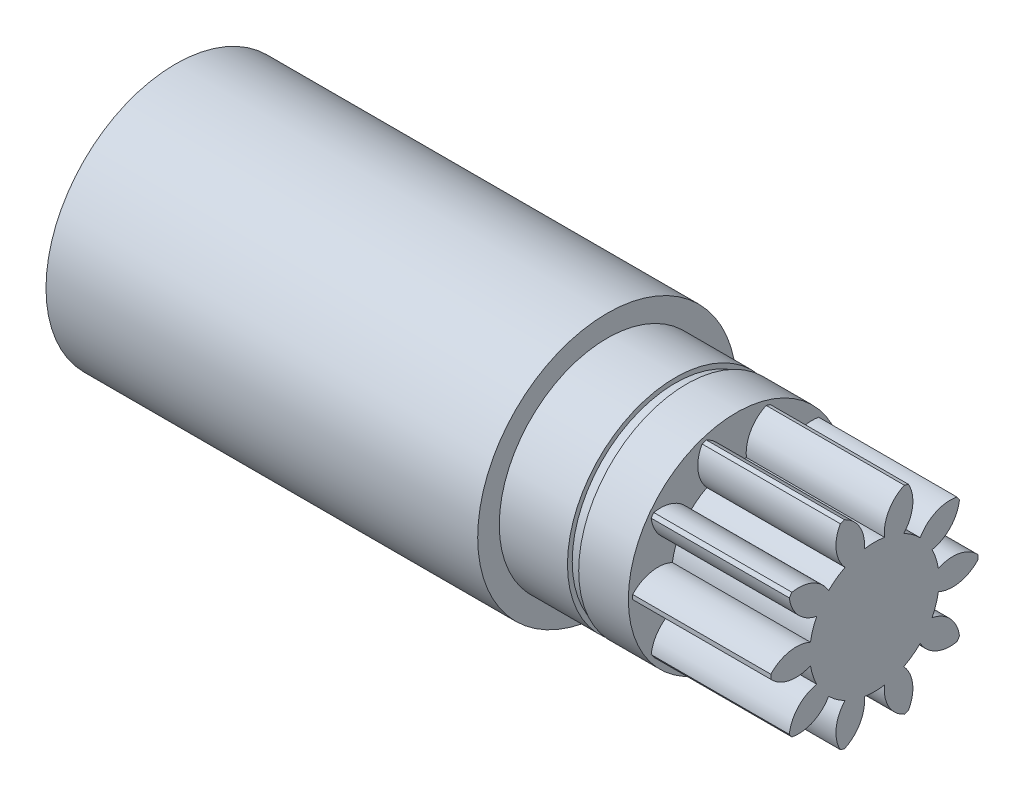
ISO-10303-21;
HEADER;
FILE_DESCRIPTION(('STEP AP214'),'2;1');
FILE_NAME('part.step','',(''),(''),'','','');
FILE_SCHEMA(('AUTOMOTIVE_DESIGN { 1 0 10303 214 1 1 1 1 }'));
ENDSEC;
DATA;
#1=APPLICATION_CONTEXT('core data for automotive mechanical design processes');
#2=APPLICATION_PROTOCOL_DEFINITION('international standard','automotive_design',2000,#1);
#3=PRODUCT_CONTEXT('',#1,'mechanical');
#4=PRODUCT('Part','Part','',(#3));
#5=PRODUCT_RELATED_PRODUCT_CATEGORY('part','',(#4));
#6=PRODUCT_DEFINITION_FORMATION('','',#4);
#7=PRODUCT_DEFINITION_CONTEXT('part definition',#1,'design');
#8=PRODUCT_DEFINITION('design','',#6,#7);
#9=PRODUCT_DEFINITION_SHAPE('','',#8);
#10=(LENGTH_UNIT() NAMED_UNIT(*) SI_UNIT(.MILLI.,.METRE.));
#11=(NAMED_UNIT(*) PLANE_ANGLE_UNIT() SI_UNIT($,.RADIAN.));
#12=(NAMED_UNIT(*) SI_UNIT($,.STERADIAN.) SOLID_ANGLE_UNIT());
#13=UNCERTAINTY_MEASURE_WITH_UNIT(LENGTH_MEASURE(1.E-05),#10,'distance_accuracy_value','');
#14=(GEOMETRIC_REPRESENTATION_CONTEXT(3) GLOBAL_UNCERTAINTY_ASSIGNED_CONTEXT((#13)) GLOBAL_UNIT_ASSIGNED_CONTEXT((#10,
#11,#12)) REPRESENTATION_CONTEXT('',''));
#15=CARTESIAN_POINT('',(0.,0.,0.));
#16=DIRECTION('',(0.,0.,1.));
#17=DIRECTION('',(1.,0.,0.));
#18=AXIS2_PLACEMENT_3D('',#15,#16,#17);
#19=CARTESIAN_POINT('',(-5.75,0.,0.));
#20=DIRECTION('',(-1.,0.,0.));
#21=DIRECTION('',(0.,0.,1.));
#22=AXIS2_PLACEMENT_3D('',#19,#20,#21);
#23=PLANE('',#22);
#24=CARTESIAN_POINT('',(-5.75,0.,0.));
#25=DIRECTION('',(-1.,0.,0.));
#26=DIRECTION('',(0.,0.,1.));
#27=AXIS2_PLACEMENT_3D('',#24,#25,#26);
#28=CIRCLE('',#27,12.5);
#29=CARTESIAN_POINT('',(-5.75,0.,12.5));
#30=VERTEX_POINT('',#29);
#31=EDGE_CURVE('E310',#30,#30,#28,.T.);
#32=ORIENTED_EDGE('',*,*,#31,.T.);
#33=EDGE_LOOP('',(#32));
#34=FACE_BOUND('',#33,.T.);
#35=CARTESIAN_POINT('',(-5.75,0.,0.));
#36=DIRECTION('',(-1.,0.,0.));
#37=DIRECTION('',(0.,0.,1.));
#38=AXIS2_PLACEMENT_3D('',#35,#36,#37);
#39=CIRCLE('',#38,11.95);
#40=CARTESIAN_POINT('',(-5.75,0.,11.95));
#41=VERTEX_POINT('',#40);
#42=EDGE_CURVE('E871',#41,#41,#39,.T.);
#43=ORIENTED_EDGE('',*,*,#42,.F.);
#44=EDGE_LOOP('',(#43));
#45=FACE_BOUND('',#44,.T.);
#46=ADVANCED_FACE('F31',(#34,#45),#23,.T.);
#47=CARTESIAN_POINT('',(16.,0.,0.));
#48=DIRECTION('',(-1.,0.,0.));
#49=DIRECTION('',(0.,0.,1.));
#50=AXIS2_PLACEMENT_3D('',#47,#48,#49);
#51=PLANE('',#50);
#52=CARTESIAN_POINT('',(16.,2.46642274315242,9.0674682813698));
#53=DIRECTION('',(-1.,0.,0.));
#54=DIRECTION('',(0.,0.951056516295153,0.309016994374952));
#55=AXIS2_PLACEMENT_3D('',#52,#53,#54);
#56=CIRCLE('',#55,4.);
#57=CARTESIAN_POINT('',(16.,-1.17254140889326,7.4067636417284));
#58=VERTEX_POINT('',#57);
#59=CARTESIAN_POINT('',(16.,-0.256880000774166,11.9972502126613));
#60=VERTEX_POINT('',#59);
#61=EDGE_CURVE('E437',#58,#60,#56,.T.);
#62=ORIENTED_EDGE('',*,*,#61,.F.);
#63=CARTESIAN_POINT('',(16.,0.,0.));
#64=DIRECTION('',(-1.,0.,0.));
#65=DIRECTION('',(0.,0.951056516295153,0.309016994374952));
#66=AXIS2_PLACEMENT_3D('',#63,#64,#65);
#67=CIRCLE('',#66,7.499);
#68=CARTESIAN_POINT('',(16.,-3.40498050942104,6.68140020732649));
#69=VERTEX_POINT('',#68);
#70=EDGE_CURVE('E441',#69,#58,#67,.T.);
#71=ORIENTED_EDGE('',*,*,#70,.F.);
#72=CARTESIAN_POINT('',(16.,-7.32510204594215,5.8860090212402));
#73=DIRECTION('',(-1.,0.,0.));
#74=DIRECTION('',(0.,0.951056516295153,0.309016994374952));
#75=AXIS2_PLACEMENT_3D('',#72,#73,#74);
#76=CIRCLE('',#75,4.);
#77=CARTESIAN_POINT('',(16.,-6.84398645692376,9.85696958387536));
#78=VERTEX_POINT('',#77);
#79=EDGE_CURVE('E439',#78,#69,#76,.T.);
#80=ORIENTED_EDGE('',*,*,#79,.F.);
#81=CARTESIAN_POINT('',(16.,0.,0.));
#82=DIRECTION('',(-1.,0.,0.));
#83=DIRECTION('',(0.,0.,1.));
#84=AXIS2_PLACEMENT_3D('',#81,#82,#83);
#85=CIRCLE('',#84,12.);
#86=CARTESIAN_POINT('',(16.,-7.25962702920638,9.55498903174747));
#87=VERTEX_POINT('',#86);
#88=EDGE_CURVE('E630',#87,#78,#85,.T.);
#89=ORIENTED_EDGE('',*,*,#88,.F.);
#90=CARTESIAN_POINT('',(16.,-3.33434621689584,8.78546284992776));
#91=DIRECTION('',(-1.,0.,0.));
#92=DIRECTION('',(0.,0.587785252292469,0.809016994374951));
#93=AXIS2_PLACEMENT_3D('',#90,#91,#92);
#94=CIRCLE('',#93,4.);
#95=CARTESIAN_POINT('',(16.,-5.30219236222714,5.30299511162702));
#96=VERTEX_POINT('',#95);
#97=EDGE_CURVE('E415',#96,#87,#94,.T.);
#98=ORIENTED_EDGE('',*,*,#97,.F.);
#99=CARTESIAN_POINT('',(16.,0.,0.));
#100=DIRECTION('',(-1.,0.,0.));
#101=DIRECTION('',(0.,0.587785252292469,0.809016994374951));
#102=AXIS2_PLACEMENT_3D('',#99,#100,#101);
#103=CIRCLE('',#102,7.499);
#104=CARTESIAN_POINT('',(16.,-6.68191560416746,3.40396898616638));
#105=VERTEX_POINT('',#104);
#106=EDGE_CURVE('E419',#105,#96,#103,.T.);
#107=ORIENTED_EDGE('',*,*,#106,.F.);
#108=CARTESIAN_POINT('',(16.,-9.38584133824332,0.456294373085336));
#109=DIRECTION('',(-1.,0.,0.));
#110=DIRECTION('',(0.,0.587785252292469,0.809016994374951));
#111=AXIS2_PLACEMENT_3D('',#108,#109,#110);
#112=CIRCLE('',#111,4.);
#113=CARTESIAN_POINT('',(16.,-11.3306827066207,3.95166160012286));
#114=VERTEX_POINT('',#113);
#115=EDGE_CURVE('E417',#114,#105,#112,.T.);
#116=ORIENTED_EDGE('',*,*,#115,.F.);
#117=CARTESIAN_POINT('',(16.,-11.4894432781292,3.46304680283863));
#118=VERTEX_POINT('',#117);
#119=EDGE_CURVE('E625',#118,#114,#85,.T.);
#120=ORIENTED_EDGE('',*,*,#119,.F.);
#121=CARTESIAN_POINT('',(16.,-7.86150825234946,5.14770921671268));
#122=DIRECTION('',(-1.,0.,0.));
#123=DIRECTION('',(0.,0.,1.));
#124=AXIS2_PLACEMENT_3D('',#121,#122,#123);
#125=CIRCLE('',#124,4.);
#126=CARTESIAN_POINT('',(16.,-7.40658604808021,1.17366269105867));
#127=VERTEX_POINT('',#126);
#128=EDGE_CURVE('E394',#127,#118,#125,.T.);
#129=ORIENTED_EDGE('',*,*,#128,.F.);
#130=CARTESIAN_POINT('',(16.,0.,0.));
#131=DIRECTION('',(-1.,0.,0.));
#132=DIRECTION('',(0.,0.,1.));
#133=AXIS2_PLACEMENT_3D('',#130,#131,#132);
#134=CIRCLE('',#133,7.499);
#135=CARTESIAN_POINT('',(16.,-7.40658604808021,-1.17366269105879));
#136=VERTEX_POINT('',#135);
#137=EDGE_CURVE('E398',#136,#127,#134,.T.);
#138=ORIENTED_EDGE('',*,*,#137,.F.);
#139=CARTESIAN_POINT('',(16.,-7.86150825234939,-5.14770921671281));
#140=DIRECTION('',(-1.,0.,0.));
#141=DIRECTION('',(0.,0.,1.));
#142=AXIS2_PLACEMENT_3D('',#139,#140,#141);
#143=CIRCLE('',#142,4.);
#144=CARTESIAN_POINT('',(16.,-11.4894432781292,-3.46304680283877));
#145=VERTEX_POINT('',#144);
#146=EDGE_CURVE('E396',#145,#136,#143,.T.);
#147=ORIENTED_EDGE('',*,*,#146,.F.);
#148=CARTESIAN_POINT('',(16.,-11.3306827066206,-3.95166160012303));
#149=VERTEX_POINT('',#148);
#150=EDGE_CURVE('E620',#149,#145,#85,.T.);
#151=ORIENTED_EDGE('',*,*,#150,.F.);
#152=CARTESIAN_POINT('',(16.,-9.3858413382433,-0.456294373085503));
#153=DIRECTION('',(-1.,0.,0.));
#154=DIRECTION('',(0.,-0.587785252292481,0.809016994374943));
#155=AXIS2_PLACEMENT_3D('',#152,#153,#154);
#156=CIRCLE('',#155,4.);
#157=CARTESIAN_POINT('',(16.,-6.68191560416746,-3.40396898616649));
#158=VERTEX_POINT('',#157);
#159=EDGE_CURVE('E372',#158,#149,#156,.T.);
#160=ORIENTED_EDGE('',*,*,#159,.F.);
#161=CARTESIAN_POINT('',(16.,0.,0.));
#162=DIRECTION('',(-1.,0.,0.));
#163=DIRECTION('',(0.,-0.587785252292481,0.809016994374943));
#164=AXIS2_PLACEMENT_3D('',#161,#162,#163);
#165=CIRCLE('',#164,7.499);
#166=CARTESIAN_POINT('',(16.,-5.30219236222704,-5.30299511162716));
#167=VERTEX_POINT('',#166);
#168=EDGE_CURVE('E376',#167,#158,#165,.T.);
#169=ORIENTED_EDGE('',*,*,#168,.F.);
#170=CARTESIAN_POINT('',(16.,-3.33434621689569,-8.78546284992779));
#171=DIRECTION('',(-1.,0.,0.));
#172=DIRECTION('',(0.,-0.587785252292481,0.809016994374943));
#173=AXIS2_PLACEMENT_3D('',#170,#171,#172);
#174=CIRCLE('',#173,4.);
#175=CARTESIAN_POINT('',(16.,-7.25962702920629,-9.55498903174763));
#176=VERTEX_POINT('',#175);
#177=EDGE_CURVE('E374',#176,#167,#174,.T.);
#178=ORIENTED_EDGE('',*,*,#177,.F.);
#179=CARTESIAN_POINT('',(16.,-6.84398645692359,-9.85696958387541));
#180=VERTEX_POINT('',#179);
#181=EDGE_CURVE('E615',#180,#176,#85,.T.);
#182=ORIENTED_EDGE('',*,*,#181,.F.);
#183=CARTESIAN_POINT('',(16.,-7.3251020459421,-5.88600902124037));
#184=DIRECTION('',(-1.,0.,0.));
#185=DIRECTION('',(0.,-0.951056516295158,0.309016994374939));
#186=AXIS2_PLACEMENT_3D('',#183,#184,#185);
#187=CIRCLE('',#186,4.);
#188=CARTESIAN_POINT('',(16.,-3.40498050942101,-6.68140020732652));
#189=VERTEX_POINT('',#188);
#190=EDGE_CURVE('E351',#189,#180,#187,.T.);
#191=ORIENTED_EDGE('',*,*,#190,.F.);
#192=CARTESIAN_POINT('',(16.,0.,0.));
#193=DIRECTION('',(-1.,0.,0.));
#194=DIRECTION('',(0.,-0.951056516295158,0.309016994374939));
#195=AXIS2_PLACEMENT_3D('',#192,#193,#194);
#196=CIRCLE('',#195,7.499);
#197=CARTESIAN_POINT('',(16.,-1.17254140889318,-7.40676364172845));
#198=VERTEX_POINT('',#197);
#199=EDGE_CURVE('E355',#198,#189,#196,.T.);
#200=ORIENTED_EDGE('',*,*,#199,.F.);
#201=CARTESIAN_POINT('',(16.,2.46642274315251,-9.06746828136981));
#202=DIRECTION('',(-1.,0.,0.));
#203=DIRECTION('',(0.,-0.951056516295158,0.309016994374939));
#204=AXIS2_PLACEMENT_3D('',#201,#202,#203);
#205=CIRCLE('',#204,4.);
#206=CARTESIAN_POINT('',(16.,-0.256880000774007,-11.9972502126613));
#207=VERTEX_POINT('',#206);
#208=EDGE_CURVE('E353',#207,#198,#205,.T.);
#209=ORIENTED_EDGE('',*,*,#208,.F.);
#210=CARTESIAN_POINT('',(16.,0.256880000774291,-11.9972502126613));
#211=VERTEX_POINT('',#210);
#212=EDGE_CURVE('E614',#211,#207,#85,.T.);
#213=ORIENTED_EDGE('',*,*,#212,.F.);
#214=CARTESIAN_POINT('',(16.,-2.46642274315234,-9.06746828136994));
#215=DIRECTION('',(-1.,0.,0.));
#216=DIRECTION('',(0.,-0.951056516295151,-0.309016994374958));
#217=AXIS2_PLACEMENT_3D('',#214,#215,#216);
#218=CIRCLE('',#217,4.);
#219=CARTESIAN_POINT('',(16.,1.17254140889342,-7.40676364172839));
#220=VERTEX_POINT('',#219);
#221=EDGE_CURVE('E332',#220,#211,#218,.T.);
#222=ORIENTED_EDGE('',*,*,#221,.F.);
#223=CARTESIAN_POINT('',(16.,0.,0.));
#224=DIRECTION('',(-1.,0.,0.));
#225=DIRECTION('',(0.,-0.951056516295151,-0.309016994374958));
#226=AXIS2_PLACEMENT_3D('',#223,#224,#225);
#227=CIRCLE('',#226,7.499);
#228=CARTESIAN_POINT('',(16.,3.40498050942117,-6.6814002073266));
#229=VERTEX_POINT('',#228);
#230=EDGE_CURVE('E336',#229,#220,#227,.T.);
#231=ORIENTED_EDGE('',*,*,#230,.F.);
#232=CARTESIAN_POINT('',(16.,7.32510204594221,-5.88600902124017));
#233=DIRECTION('',(-1.,0.,0.));
#234=DIRECTION('',(0.,-0.951056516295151,-0.309016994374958));
#235=AXIS2_PLACEMENT_3D('',#232,#233,#234);
#236=CIRCLE('',#235,4.);
#237=CARTESIAN_POINT('',(16.,6.84398645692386,-9.85696958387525));
#238=VERTEX_POINT('',#237);
#239=EDGE_CURVE('E334',#238,#229,#236,.T.);
#240=ORIENTED_EDGE('',*,*,#239,.F.);
#241=CARTESIAN_POINT('',(16.,7.2596270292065,-9.55498903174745));
#242=VERTEX_POINT('',#241);
#243=EDGE_CURVE('E528',#242,#238,#85,.T.);
#244=ORIENTED_EDGE('',*,*,#243,.F.);
#245=CARTESIAN_POINT('',(16.,3.33434621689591,-8.78546284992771));
#246=DIRECTION('',(-1.,0.,0.));
#247=DIRECTION('',(0.,-0.587785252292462,-0.809016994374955));
#248=AXIS2_PLACEMENT_3D('',#245,#246,#247);
#249=CIRCLE('',#248,4.);
#250=CARTESIAN_POINT('',(16.,5.30219236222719,-5.30299511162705));
#251=VERTEX_POINT('',#250);
#252=EDGE_CURVE('E316',#251,#242,#249,.T.);
#253=ORIENTED_EDGE('',*,*,#252,.F.);
#254=CARTESIAN_POINT('',(16.,0.,0.));
#255=DIRECTION('',(-1.,0.,0.));
#256=DIRECTION('',(0.,-0.587785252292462,-0.809016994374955));
#257=AXIS2_PLACEMENT_3D('',#254,#255,#256);
#258=CIRCLE('',#257,7.499);
#259=CARTESIAN_POINT('',(16.,6.68191560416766,-3.40396898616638));
#260=VERTEX_POINT('',#259);
#261=EDGE_CURVE('E297',#260,#251,#258,.T.);
#262=ORIENTED_EDGE('',*,*,#261,.F.);
#263=CARTESIAN_POINT('',(16.,9.38584133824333,-0.456294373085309));
#264=DIRECTION('',(-1.,0.,0.));
#265=DIRECTION('',(0.,-0.587785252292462,-0.809016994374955));
#266=AXIS2_PLACEMENT_3D('',#263,#264,#265);
#267=CIRCLE('',#266,4.);
#268=CARTESIAN_POINT('',(16.,11.3306827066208,-3.95166160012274));
#269=VERTEX_POINT('',#268);
#270=EDGE_CURVE('E318',#269,#260,#267,.T.);
#271=ORIENTED_EDGE('',*,*,#270,.F.);
#272=CARTESIAN_POINT('',(16.,11.4894432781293,-3.46304680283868));
#273=VERTEX_POINT('',#272);
#274=EDGE_CURVE('E524',#273,#269,#85,.T.);
#275=ORIENTED_EDGE('',*,*,#274,.F.);
#276=CARTESIAN_POINT('',(16.,7.86150825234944,-5.1477092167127));
#277=DIRECTION('',(-1.,0.,0.));
#278=DIRECTION('',(0.,0.,-1.));
#279=AXIS2_PLACEMENT_3D('',#276,#277,#278);
#280=CIRCLE('',#279,4.);
#281=CARTESIAN_POINT('',(16.,7.40658604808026,-1.17366269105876));
#282=VERTEX_POINT('',#281);
#283=EDGE_CURVE('E503',#282,#273,#280,.T.);
#284=ORIENTED_EDGE('',*,*,#283,.F.);
#285=CARTESIAN_POINT('',(16.,0.,0.));
#286=DIRECTION('',(-1.,0.,0.));
#287=DIRECTION('',(0.,0.,-1.));
#288=AXIS2_PLACEMENT_3D('',#285,#286,#287);
#289=CIRCLE('',#288,7.499);
#290=CARTESIAN_POINT('',(16.,7.40658604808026,1.1736626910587));
#291=VERTEX_POINT('',#290);
#292=EDGE_CURVE('E507',#291,#282,#289,.T.);
#293=ORIENTED_EDGE('',*,*,#292,.F.);
#294=CARTESIAN_POINT('',(16.,7.86150825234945,5.14770921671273));
#295=DIRECTION('',(-1.,0.,0.));
#296=DIRECTION('',(0.,0.,-1.));
#297=AXIS2_PLACEMENT_3D('',#294,#295,#296);
#298=CIRCLE('',#297,4.);
#299=CARTESIAN_POINT('',(16.,11.4894432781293,3.46304680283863));
#300=VERTEX_POINT('',#299);
#301=EDGE_CURVE('E505',#300,#291,#298,.T.);
#302=ORIENTED_EDGE('',*,*,#301,.F.);
#303=CARTESIAN_POINT('',(16.,11.3306827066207,3.95166160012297));
#304=VERTEX_POINT('',#303);
#305=EDGE_CURVE('E522',#304,#300,#85,.T.);
#306=ORIENTED_EDGE('',*,*,#305,.F.);
#307=CARTESIAN_POINT('',(16.,9.38584133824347,0.45629437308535));
#308=DIRECTION('',(-1.,0.,0.));
#309=DIRECTION('',(0.,0.587785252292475,-0.809016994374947));
#310=AXIS2_PLACEMENT_3D('',#307,#308,#309);
#311=CIRCLE('',#310,4.);
#312=CARTESIAN_POINT('',(16.,6.68191560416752,3.40396898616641));
#313=VERTEX_POINT('',#312);
#314=EDGE_CURVE('E481',#313,#304,#311,.T.);
#315=ORIENTED_EDGE('',*,*,#314,.F.);
#316=CARTESIAN_POINT('',(16.,0.,0.));
#317=DIRECTION('',(-1.,0.,0.));
#318=DIRECTION('',(0.,0.587785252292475,-0.809016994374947));
#319=AXIS2_PLACEMENT_3D('',#316,#317,#318);
#320=CIRCLE('',#319,7.499);
#321=CARTESIAN_POINT('',(16.,5.30219236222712,5.30299511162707));
#322=VERTEX_POINT('',#321);
#323=EDGE_CURVE('E485',#322,#313,#320,.T.);
#324=ORIENTED_EDGE('',*,*,#323,.F.);
#325=CARTESIAN_POINT('',(16.,3.33434621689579,8.78546284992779));
#326=DIRECTION('',(-1.,0.,0.));
#327=DIRECTION('',(0.,0.587785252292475,-0.809016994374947));
#328=AXIS2_PLACEMENT_3D('',#325,#326,#327);
#329=CIRCLE('',#328,4.);
#330=CARTESIAN_POINT('',(16.,7.25962702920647,9.55498903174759));
#331=VERTEX_POINT('',#330);
#332=EDGE_CURVE('E483',#331,#322,#329,.T.);
#333=ORIENTED_EDGE('',*,*,#332,.F.);
#334=CARTESIAN_POINT('',(16.,6.84398645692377,9.85696958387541));
#335=VERTEX_POINT('',#334);
#336=EDGE_CURVE('E640',#335,#331,#85,.T.);
#337=ORIENTED_EDGE('',*,*,#336,.F.);
#338=CARTESIAN_POINT('',(16.,7.32510204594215,5.88600902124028));
#339=DIRECTION('',(-1.,0.,0.));
#340=DIRECTION('',(0.,0.951056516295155,-0.309016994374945));
#341=AXIS2_PLACEMENT_3D('',#338,#339,#340);
#342=CIRCLE('',#341,4.);
#343=CARTESIAN_POINT('',(16.,3.40498050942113,6.68140020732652));
#344=VERTEX_POINT('',#343);
#345=EDGE_CURVE('E459',#344,#335,#342,.T.);
#346=ORIENTED_EDGE('',*,*,#345,.F.);
#347=CARTESIAN_POINT('',(16.,0.,0.));
#348=DIRECTION('',(-1.,0.,0.));
#349=DIRECTION('',(0.,0.951056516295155,-0.309016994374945));
#350=AXIS2_PLACEMENT_3D('',#347,#348,#349);
#351=CIRCLE('',#350,7.499);
#352=CARTESIAN_POINT('',(16.,1.17254140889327,7.40676364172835));
#353=VERTEX_POINT('',#352);
#354=EDGE_CURVE('E463',#353,#344,#351,.T.);
#355=ORIENTED_EDGE('',*,*,#354,.F.);
#356=CARTESIAN_POINT('',(16.,-2.46642274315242,9.06746828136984));
#357=DIRECTION('',(-1.,0.,0.));
#358=DIRECTION('',(0.,0.951056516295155,-0.309016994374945));
#359=AXIS2_PLACEMENT_3D('',#356,#357,#358);
#360=CIRCLE('',#359,4.);
#361=CARTESIAN_POINT('',(16.,0.256880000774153,11.9972502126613));
#362=VERTEX_POINT('',#361);
#363=EDGE_CURVE('E461',#362,#353,#360,.T.);
#364=ORIENTED_EDGE('',*,*,#363,.F.);
#365=EDGE_CURVE('E635',#60,#362,#85,.T.);
#366=ORIENTED_EDGE('',*,*,#365,.F.);
#367=EDGE_LOOP('',(#62,#71,#80,#89,#98,#107,#116,#120,#129,#138,#147,#151,#160,#169,#178,#182,
#191,#200,#209,#213,#222,#231,#240,#244,#253,#262,#271,#275,#284,#293,#302,#306,#315,#324,#333,
#337,#346,#355,#364,#366));
#368=FACE_BOUND('',#367,.T.);
#369=ADVANCED_FACE('F33',(#368),#51,.F.);
#370=CARTESIAN_POINT('',(-10.,0.,0.));
#371=DIRECTION('',(-1.,0.,0.));
#372=DIRECTION('',(0.,0.,1.));
#373=AXIS2_PLACEMENT_3D('',#370,#371,#372);
#374=CYLINDRICAL_SURFACE('',#373,12.);
#375=DIRECTION('',(-1.,0.,0.));
#376=VECTOR('',#375,1.);
#377=CARTESIAN_POINT('',(8.,7.2596270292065,-9.55498903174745));
#378=LINE('',#377,#376);
#379=CARTESIAN_POINT('',(0.,7.2596270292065,-9.55498903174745));
#380=VERTEX_POINT('',#379);
#381=EDGE_CURVE('E306',#242,#380,#378,.T.);
#382=ORIENTED_EDGE('',*,*,#381,.F.);
#383=ORIENTED_EDGE('',*,*,#243,.T.);
#384=DIRECTION('',(-1.,0.,0.));
#385=VECTOR('',#384,1.);
#386=CARTESIAN_POINT('',(8.,6.84398645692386,-9.85696958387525));
#387=LINE('',#386,#385);
#388=CARTESIAN_POINT('',(0.,6.84398645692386,-9.85696958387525));
#389=VERTEX_POINT('',#388);
#390=EDGE_CURVE('E342',#389,#238,#387,.F.);
#391=ORIENTED_EDGE('',*,*,#390,.F.);
#392=CARTESIAN_POINT('',(0.,0.,0.));
#393=DIRECTION('',(-1.,0.,0.));
#394=DIRECTION('',(0.,0.,1.));
#395=AXIS2_PLACEMENT_3D('',#392,#393,#394);
#396=CIRCLE('',#395,12.);
#397=EDGE_CURVE('E523',#380,#389,#396,.T.);
#398=ORIENTED_EDGE('',*,*,#397,.F.);
#399=EDGE_LOOP('',(#382,#383,#391,#398));
#400=FACE_BOUND('',#399,.T.);
#401=ADVANCED_FACE('F551',(#400),#374,.T.);
#402=DIRECTION('',(-1.,0.,0.));
#403=VECTOR('',#402,1.);
#404=CARTESIAN_POINT('',(8.,11.3306827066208,-3.95166160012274));
#405=LINE('',#404,#403);
#406=CARTESIAN_POINT('',(0.,11.3306827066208,-3.95166160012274));
#407=VERTEX_POINT('',#406);
#408=EDGE_CURVE('E325',#407,#269,#405,.F.);
#409=ORIENTED_EDGE('',*,*,#408,.F.);
#410=CARTESIAN_POINT('',(0.,11.4894432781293,-3.46304680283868));
#411=VERTEX_POINT('',#410);
#412=EDGE_CURVE('E520',#411,#407,#396,.T.);
#413=ORIENTED_EDGE('',*,*,#412,.F.);
#414=DIRECTION('',(-1.,0.,0.));
#415=VECTOR('',#414,1.);
#416=CARTESIAN_POINT('',(8.,11.4894432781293,-3.46304680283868));
#417=LINE('',#416,#415);
#418=EDGE_CURVE('E517',#273,#411,#417,.T.);
#419=ORIENTED_EDGE('',*,*,#418,.F.);
#420=ORIENTED_EDGE('',*,*,#274,.T.);
#421=EDGE_LOOP('',(#409,#413,#419,#420));
#422=FACE_BOUND('',#421,.T.);
#423=ADVANCED_FACE('F609',(#422),#374,.T.);
#424=DIRECTION('',(-1.,0.,0.));
#425=VECTOR('',#424,1.);
#426=CARTESIAN_POINT('',(8.,0.256880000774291,-11.9972502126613));
#427=LINE('',#426,#425);
#428=CARTESIAN_POINT('',(0.,0.256880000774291,-11.9972502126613));
#429=VERTEX_POINT('',#428);
#430=EDGE_CURVE('E345',#211,#429,#427,.T.);
#431=ORIENTED_EDGE('',*,*,#430,.F.);
#432=ORIENTED_EDGE('',*,*,#212,.T.);
#433=DIRECTION('',(-1.,0.,0.));
#434=VECTOR('',#433,1.);
#435=CARTESIAN_POINT('',(8.,-0.256880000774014,-11.9972502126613));
#436=LINE('',#435,#434);
#437=CARTESIAN_POINT('',(0.,-0.256880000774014,-11.9972502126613));
#438=VERTEX_POINT('',#437);
#439=EDGE_CURVE('E361',#438,#207,#436,.F.);
#440=ORIENTED_EDGE('',*,*,#439,.F.);
#441=EDGE_CURVE('E553',#429,#438,#396,.T.);
#442=ORIENTED_EDGE('',*,*,#441,.F.);
#443=EDGE_LOOP('',(#431,#432,#440,#442));
#444=FACE_BOUND('',#443,.T.);
#445=ADVANCED_FACE('F944',(#444),#374,.T.);
#446=DIRECTION('',(-1.,0.,0.));
#447=VECTOR('',#446,1.);
#448=CARTESIAN_POINT('',(8.,-6.84398645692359,-9.85696958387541));
#449=LINE('',#448,#447);
#450=CARTESIAN_POINT('',(0.,-6.84398645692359,-9.85696958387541));
#451=VERTEX_POINT('',#450);
#452=EDGE_CURVE('E364',#180,#451,#449,.T.);
#453=ORIENTED_EDGE('',*,*,#452,.F.);
#454=ORIENTED_EDGE('',*,*,#181,.T.);
#455=DIRECTION('',(-1.,0.,0.));
#456=VECTOR('',#455,1.);
#457=CARTESIAN_POINT('',(8.,-7.25962702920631,-9.55498903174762));
#458=LINE('',#457,#456);
#459=CARTESIAN_POINT('',(0.,-7.25962702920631,-9.55498903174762));
#460=VERTEX_POINT('',#459);
#461=EDGE_CURVE('E383',#460,#176,#458,.F.);
#462=ORIENTED_EDGE('',*,*,#461,.F.);
#463=EDGE_CURVE('E555',#451,#460,#396,.T.);
#464=ORIENTED_EDGE('',*,*,#463,.F.);
#465=EDGE_LOOP('',(#453,#454,#462,#464));
#466=FACE_BOUND('',#465,.T.);
#467=ADVANCED_FACE('F938',(#466),#374,.T.);
#468=DIRECTION('',(-1.,0.,0.));
#469=VECTOR('',#468,1.);
#470=CARTESIAN_POINT('',(8.,-11.3306827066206,-3.95166160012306));
#471=LINE('',#470,#469);
#472=CARTESIAN_POINT('',(0.,-11.3306827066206,-3.95166160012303));
#473=VERTEX_POINT('',#472);
#474=EDGE_CURVE('E386',#149,#473,#471,.T.);
#475=ORIENTED_EDGE('',*,*,#474,.F.);
#476=ORIENTED_EDGE('',*,*,#150,.T.);
#477=DIRECTION('',(-1.,0.,0.));
#478=VECTOR('',#477,1.);
#479=CARTESIAN_POINT('',(8.,-11.4894432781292,-3.46304680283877));
#480=LINE('',#479,#478);
#481=CARTESIAN_POINT('',(0.,-11.4894432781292,-3.46304680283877));
#482=VERTEX_POINT('',#481);
#483=EDGE_CURVE('E405',#482,#145,#480,.F.);
#484=ORIENTED_EDGE('',*,*,#483,.F.);
#485=EDGE_CURVE('E559',#473,#482,#396,.T.);
#486=ORIENTED_EDGE('',*,*,#485,.F.);
#487=EDGE_LOOP('',(#475,#476,#484,#486));
#488=FACE_BOUND('',#487,.T.);
#489=ADVANCED_FACE('F931',(#488),#374,.T.);
#490=DIRECTION('',(-1.,0.,0.));
#491=VECTOR('',#490,1.);
#492=CARTESIAN_POINT('',(8.,-11.4894432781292,3.46304680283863));
#493=LINE('',#492,#491);
#494=CARTESIAN_POINT('',(0.,-11.4894432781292,3.46304680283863));
#495=VERTEX_POINT('',#494);
#496=EDGE_CURVE('E408',#118,#495,#493,.T.);
#497=ORIENTED_EDGE('',*,*,#496,.F.);
#498=ORIENTED_EDGE('',*,*,#119,.T.);
#499=DIRECTION('',(-1.,0.,0.));
#500=VECTOR('',#499,1.);
#501=CARTESIAN_POINT('',(8.,-11.3306827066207,3.95166160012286));
#502=LINE('',#501,#500);
#503=CARTESIAN_POINT('',(0.,-11.3306827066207,3.95166160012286));
#504=VERTEX_POINT('',#503);
#505=EDGE_CURVE('E426',#504,#114,#502,.F.);
#506=ORIENTED_EDGE('',*,*,#505,.F.);
#507=EDGE_CURVE('E563',#495,#504,#396,.T.);
#508=ORIENTED_EDGE('',*,*,#507,.F.);
#509=EDGE_LOOP('',(#497,#498,#506,#508));
#510=FACE_BOUND('',#509,.T.);
#511=ADVANCED_FACE('F924',(#510),#374,.T.);
#512=DIRECTION('',(-1.,0.,0.));
#513=VECTOR('',#512,1.);
#514=CARTESIAN_POINT('',(8.,-7.25962702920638,9.55498903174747));
#515=LINE('',#514,#513);
#516=CARTESIAN_POINT('',(0.,-7.25962702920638,9.55498903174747));
#517=VERTEX_POINT('',#516);
#518=EDGE_CURVE('E429',#87,#517,#515,.T.);
#519=ORIENTED_EDGE('',*,*,#518,.F.);
#520=ORIENTED_EDGE('',*,*,#88,.T.);
#521=DIRECTION('',(-1.,0.,0.));
#522=VECTOR('',#521,1.);
#523=CARTESIAN_POINT('',(8.,-6.84398645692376,9.85696958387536));
#524=LINE('',#523,#522);
#525=CARTESIAN_POINT('',(0.,-6.84398645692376,9.85696958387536));
#526=VERTEX_POINT('',#525);
#527=EDGE_CURVE('E448',#526,#78,#524,.F.);
#528=ORIENTED_EDGE('',*,*,#527,.F.);
#529=EDGE_CURVE('E567',#517,#526,#396,.T.);
#530=ORIENTED_EDGE('',*,*,#529,.F.);
#531=EDGE_LOOP('',(#519,#520,#528,#530));
#532=FACE_BOUND('',#531,.T.);
#533=ADVANCED_FACE('F917',(#532),#374,.T.);
#534=DIRECTION('',(-1.,0.,0.));
#535=VECTOR('',#534,1.);
#536=CARTESIAN_POINT('',(8.,-0.256880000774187,11.9972502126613));
#537=LINE('',#536,#535);
#538=CARTESIAN_POINT('',(0.,-0.256880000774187,11.9972502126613));
#539=VERTEX_POINT('',#538);
#540=EDGE_CURVE('E451',#60,#539,#537,.T.);
#541=ORIENTED_EDGE('',*,*,#540,.F.);
#542=ORIENTED_EDGE('',*,*,#365,.T.);
#543=DIRECTION('',(-1.,0.,0.));
#544=VECTOR('',#543,1.);
#545=CARTESIAN_POINT('',(8.,0.256880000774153,11.9972502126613));
#546=LINE('',#545,#544);
#547=CARTESIAN_POINT('',(0.,0.256880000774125,11.9972502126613));
#548=VERTEX_POINT('',#547);
#549=EDGE_CURVE('E470',#548,#362,#546,.F.);
#550=ORIENTED_EDGE('',*,*,#549,.F.);
#551=EDGE_CURVE('E571',#539,#548,#396,.T.);
#552=ORIENTED_EDGE('',*,*,#551,.F.);
#553=EDGE_LOOP('',(#541,#542,#550,#552));
#554=FACE_BOUND('',#553,.T.);
#555=ADVANCED_FACE('F910',(#554),#374,.T.);
#556=DIRECTION('',(-1.,0.,0.));
#557=VECTOR('',#556,1.);
#558=CARTESIAN_POINT('',(8.,6.84398645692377,9.85696958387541));
#559=LINE('',#558,#557);
#560=CARTESIAN_POINT('',(0.,6.84398645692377,9.85696958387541));
#561=VERTEX_POINT('',#560);
#562=EDGE_CURVE('E473',#335,#561,#559,.T.);
#563=ORIENTED_EDGE('',*,*,#562,.F.);
#564=ORIENTED_EDGE('',*,*,#336,.T.);
#565=DIRECTION('',(-1.,0.,0.));
#566=VECTOR('',#565,1.);
#567=CARTESIAN_POINT('',(8.,7.25962702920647,9.55498903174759));
#568=LINE('',#567,#566);
#569=CARTESIAN_POINT('',(0.,7.25962702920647,9.55498903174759));
#570=VERTEX_POINT('',#569);
#571=EDGE_CURVE('E492',#570,#331,#568,.F.);
#572=ORIENTED_EDGE('',*,*,#571,.F.);
#573=EDGE_CURVE('E575',#561,#570,#396,.T.);
#574=ORIENTED_EDGE('',*,*,#573,.F.);
#575=EDGE_LOOP('',(#563,#564,#572,#574));
#576=FACE_BOUND('',#575,.T.);
#577=ADVANCED_FACE('F649',(#576),#374,.T.);
#578=DIRECTION('',(-1.,0.,0.));
#579=VECTOR('',#578,1.);
#580=CARTESIAN_POINT('',(8.,11.3306827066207,3.95166160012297));
#581=LINE('',#580,#579);
#582=CARTESIAN_POINT('',(0.,11.3306827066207,3.95166160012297));
#583=VERTEX_POINT('',#582);
#584=EDGE_CURVE('E495',#304,#583,#581,.T.);
#585=ORIENTED_EDGE('',*,*,#584,.F.);
#586=ORIENTED_EDGE('',*,*,#305,.T.);
#587=DIRECTION('',(-1.,0.,0.));
#588=VECTOR('',#587,1.);
#589=CARTESIAN_POINT('',(8.,11.4894432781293,3.46304680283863));
#590=LINE('',#589,#588);
#591=CARTESIAN_POINT('',(0.,11.4894432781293,3.46304680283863));
#592=VERTEX_POINT('',#591);
#593=EDGE_CURVE('E514',#592,#300,#590,.F.);
#594=ORIENTED_EDGE('',*,*,#593,.F.);
#595=EDGE_CURVE('E519',#583,#592,#396,.T.);
#596=ORIENTED_EDGE('',*,*,#595,.F.);
#597=EDGE_LOOP('',(#585,#586,#594,#596));
#598=FACE_BOUND('',#597,.T.);
#599=ADVANCED_FACE('F587',(#598),#374,.T.);
#600=CARTESIAN_POINT('',(16.,7.86150825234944,-5.1477092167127));
#601=DIRECTION('',(-1.,0.,0.));
#602=DIRECTION('',(0.,0.,1.));
#603=AXIS2_PLACEMENT_3D('',#600,#601,#602);
#604=CYLINDRICAL_SURFACE('',#603,4.);
#605=ORIENTED_EDGE('',*,*,#418,.T.);
#606=CARTESIAN_POINT('',(0.,7.86150825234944,-5.1477092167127));
#607=DIRECTION('',(-1.,0.,0.));
#608=DIRECTION('',(0.,0.,-1.));
#609=AXIS2_PLACEMENT_3D('',#606,#607,#608);
#610=CIRCLE('',#609,4.);
#611=CARTESIAN_POINT('',(0.,7.40658604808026,-1.17366269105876));
#612=VERTEX_POINT('',#611);
#613=EDGE_CURVE('E497',#612,#411,#610,.T.);
#614=ORIENTED_EDGE('',*,*,#613,.F.);
#615=DIRECTION('',(-1.,0.,0.));
#616=VECTOR('',#615,1.);
#617=CARTESIAN_POINT('',(16.,7.40658604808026,-1.17366269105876));
#618=LINE('',#617,#616);
#619=EDGE_CURVE('E509',#282,#612,#618,.T.);
#620=ORIENTED_EDGE('',*,*,#619,.F.);
#621=ORIENTED_EDGE('',*,*,#283,.T.);
#622=EDGE_LOOP('',(#605,#614,#620,#621));
#623=FACE_BOUND('',#622,.T.);
#624=ADVANCED_FACE('F604',(#623),#604,.T.);
#625=CARTESIAN_POINT('',(16.,7.86150825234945,5.14770921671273));
#626=DIRECTION('',(-1.,0.,0.));
#627=DIRECTION('',(0.,0.,1.));
#628=AXIS2_PLACEMENT_3D('',#625,#626,#627);
#629=CYLINDRICAL_SURFACE('',#628,4.);
#630=ORIENTED_EDGE('',*,*,#593,.T.);
#631=ORIENTED_EDGE('',*,*,#301,.T.);
#632=DIRECTION('',(-1.,0.,0.));
#633=VECTOR('',#632,1.);
#634=CARTESIAN_POINT('',(16.,7.40658604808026,1.1736626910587));
#635=LINE('',#634,#633);
#636=CARTESIAN_POINT('',(0.,7.40658604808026,1.1736626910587));
#637=VERTEX_POINT('',#636);
#638=EDGE_CURVE('E512',#291,#637,#635,.T.);
#639=ORIENTED_EDGE('',*,*,#638,.T.);
#640=CARTESIAN_POINT('',(0.,7.86150825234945,5.14770921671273));
#641=DIRECTION('',(1.,0.,0.));
#642=DIRECTION('',(0.,0.,-1.));
#643=AXIS2_PLACEMENT_3D('',#640,#641,#642);
#644=CIRCLE('',#643,4.);
#645=EDGE_CURVE('E527',#637,#592,#644,.T.);
#646=ORIENTED_EDGE('',*,*,#645,.T.);
#647=EDGE_LOOP('',(#630,#631,#639,#646));
#648=FACE_BOUND('',#647,.T.);
#649=ADVANCED_FACE('F591',(#648),#629,.T.);
#650=CARTESIAN_POINT('',(16.,0.,0.));
#651=DIRECTION('',(-1.,0.,0.));
#652=DIRECTION('',(0.,0.,1.));
#653=AXIS2_PLACEMENT_3D('',#650,#651,#652);
#654=CYLINDRICAL_SURFACE('',#653,7.499);
#655=CARTESIAN_POINT('',(0.,0.,0.));
#656=DIRECTION('',(-1.,0.,0.));
#657=DIRECTION('',(0.,0.,-1.));
#658=AXIS2_PLACEMENT_3D('',#655,#656,#657);
#659=CIRCLE('',#658,7.499);
#660=EDGE_CURVE('E500',#637,#612,#659,.T.);
#661=ORIENTED_EDGE('',*,*,#660,.F.);
#662=ORIENTED_EDGE('',*,*,#638,.F.);
#663=ORIENTED_EDGE('',*,*,#292,.T.);
#664=ORIENTED_EDGE('',*,*,#619,.T.);
#665=EDGE_LOOP('',(#661,#662,#663,#664));
#666=FACE_BOUND('',#665,.T.);
#667=ADVANCED_FACE('F602',(#666),#654,.T.);
#668=CARTESIAN_POINT('',(16.,9.38584133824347,0.45629437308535));
#669=DIRECTION('',(-1.,0.,0.));
#670=DIRECTION('',(0.,0.,1.));
#671=AXIS2_PLACEMENT_3D('',#668,#669,#670);
#672=CYLINDRICAL_SURFACE('',#671,4.);
#673=ORIENTED_EDGE('',*,*,#584,.T.);
#674=CARTESIAN_POINT('',(0.,9.38584133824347,0.45629437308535));
#675=DIRECTION('',(-1.,0.,0.));
#676=DIRECTION('',(0.,0.587785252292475,-0.809016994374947));
#677=AXIS2_PLACEMENT_3D('',#674,#675,#676);
#678=CIRCLE('',#677,4.);
#679=CARTESIAN_POINT('',(0.,6.68191560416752,3.40396898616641));
#680=VERTEX_POINT('',#679);
#681=EDGE_CURVE('E475',#680,#583,#678,.T.);
#682=ORIENTED_EDGE('',*,*,#681,.F.);
#683=DIRECTION('',(-1.,0.,0.));
#684=VECTOR('',#683,1.);
#685=CARTESIAN_POINT('',(16.,6.68191560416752,3.40396898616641));
#686=LINE('',#685,#684);
#687=EDGE_CURVE('E487',#313,#680,#686,.T.);
#688=ORIENTED_EDGE('',*,*,#687,.F.);
#689=ORIENTED_EDGE('',*,*,#314,.T.);
#690=EDGE_LOOP('',(#673,#682,#688,#689));
#691=FACE_BOUND('',#690,.T.);
#692=ADVANCED_FACE('F661',(#691),#672,.T.);
#693=CARTESIAN_POINT('',(16.,3.33434621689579,8.78546284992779));
#694=DIRECTION('',(-1.,0.,0.));
#695=DIRECTION('',(0.,0.,1.));
#696=AXIS2_PLACEMENT_3D('',#693,#694,#695);
#697=CYLINDRICAL_SURFACE('',#696,4.);
#698=ORIENTED_EDGE('',*,*,#571,.T.);
#699=ORIENTED_EDGE('',*,*,#332,.T.);
#700=DIRECTION('',(-1.,0.,0.));
#701=VECTOR('',#700,1.);
#702=CARTESIAN_POINT('',(16.,5.30219236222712,5.30299511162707));
#703=LINE('',#702,#701);
#704=CARTESIAN_POINT('',(0.,5.30219236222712,5.30299511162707));
#705=VERTEX_POINT('',#704);
#706=EDGE_CURVE('E490',#322,#705,#703,.T.);
#707=ORIENTED_EDGE('',*,*,#706,.T.);
#708=CARTESIAN_POINT('',(0.,3.33434621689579,8.78546284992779));
#709=DIRECTION('',(1.,0.,0.));
#710=DIRECTION('',(0.,0.,-1.));
#711=AXIS2_PLACEMENT_3D('',#708,#709,#710);
#712=CIRCLE('',#711,4.);
#713=EDGE_CURVE('E530',#705,#570,#712,.T.);
#714=ORIENTED_EDGE('',*,*,#713,.T.);
#715=EDGE_LOOP('',(#698,#699,#707,#714));
#716=FACE_BOUND('',#715,.T.);
#717=ADVANCED_FACE('F653',(#716),#697,.T.);
#718=CARTESIAN_POINT('',(16.,0.,0.));
#719=DIRECTION('',(-1.,0.,0.));
#720=DIRECTION('',(0.,0.,1.));
#721=AXIS2_PLACEMENT_3D('',#718,#719,#720);
#722=CYLINDRICAL_SURFACE('',#721,7.499);
#723=CARTESIAN_POINT('',(0.,0.,0.));
#724=DIRECTION('',(-1.,0.,0.));
#725=DIRECTION('',(0.,0.587785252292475,-0.809016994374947));
#726=AXIS2_PLACEMENT_3D('',#723,#724,#725);
#727=CIRCLE('',#726,7.499);
#728=EDGE_CURVE('E478',#705,#680,#727,.T.);
#729=ORIENTED_EDGE('',*,*,#728,.F.);
#730=ORIENTED_EDGE('',*,*,#706,.F.);
#731=ORIENTED_EDGE('',*,*,#323,.T.);
#732=ORIENTED_EDGE('',*,*,#687,.T.);
#733=EDGE_LOOP('',(#729,#730,#731,#732));
#734=FACE_BOUND('',#733,.T.);
#735=ADVANCED_FACE('F659',(#734),#722,.T.);
#736=CARTESIAN_POINT('',(16.,7.32510204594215,5.88600902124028));
#737=DIRECTION('',(-1.,0.,0.));
#738=DIRECTION('',(0.,0.,1.));
#739=AXIS2_PLACEMENT_3D('',#736,#737,#738);
#740=CYLINDRICAL_SURFACE('',#739,4.);
#741=ORIENTED_EDGE('',*,*,#562,.T.);
#742=CARTESIAN_POINT('',(0.,7.32510204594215,5.88600902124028));
#743=DIRECTION('',(-1.,0.,0.));
#744=DIRECTION('',(0.,0.951056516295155,-0.309016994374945));
#745=AXIS2_PLACEMENT_3D('',#742,#743,#744);
#746=CIRCLE('',#745,4.);
#747=CARTESIAN_POINT('',(0.,3.40498050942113,6.68140020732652));
#748=VERTEX_POINT('',#747);
#749=EDGE_CURVE('E453',#748,#561,#746,.T.);
#750=ORIENTED_EDGE('',*,*,#749,.F.);
#751=DIRECTION('',(-1.,0.,0.));
#752=VECTOR('',#751,1.);
#753=CARTESIAN_POINT('',(16.,3.40498050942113,6.68140020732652));
#754=LINE('',#753,#752);
#755=EDGE_CURVE('E465',#344,#748,#754,.T.);
#756=ORIENTED_EDGE('',*,*,#755,.F.);
#757=ORIENTED_EDGE('',*,*,#345,.T.);
#758=EDGE_LOOP('',(#741,#750,#756,#757));
#759=FACE_BOUND('',#758,.T.);
#760=ADVANCED_FACE('F769',(#759),#740,.T.);
#761=CARTESIAN_POINT('',(16.,-2.46642274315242,9.06746828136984));
#762=DIRECTION('',(-1.,0.,0.));
#763=DIRECTION('',(0.,0.,1.));
#764=AXIS2_PLACEMENT_3D('',#761,#762,#763);
#765=CYLINDRICAL_SURFACE('',#764,4.);
#766=ORIENTED_EDGE('',*,*,#549,.T.);
#767=ORIENTED_EDGE('',*,*,#363,.T.);
#768=DIRECTION('',(-1.,0.,0.));
#769=VECTOR('',#768,1.);
#770=CARTESIAN_POINT('',(16.,1.17254140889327,7.40676364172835));
#771=LINE('',#770,#769);
#772=CARTESIAN_POINT('',(0.,1.17254140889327,7.40676364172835));
#773=VERTEX_POINT('',#772);
#774=EDGE_CURVE('E468',#353,#773,#771,.T.);
#775=ORIENTED_EDGE('',*,*,#774,.T.);
#776=CARTESIAN_POINT('',(0.,-2.46642274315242,9.06746828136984));
#777=DIRECTION('',(1.,0.,0.));
#778=DIRECTION('',(0.,0.,-1.));
#779=AXIS2_PLACEMENT_3D('',#776,#777,#778);
#780=CIRCLE('',#779,4.);
#781=EDGE_CURVE('E532',#773,#548,#780,.T.);
#782=ORIENTED_EDGE('',*,*,#781,.T.);
#783=EDGE_LOOP('',(#766,#767,#775,#782));
#784=FACE_BOUND('',#783,.T.);
#785=ADVANCED_FACE('F765',(#784),#765,.T.);
#786=CARTESIAN_POINT('',(16.,0.,0.));
#787=DIRECTION('',(-1.,0.,0.));
#788=DIRECTION('',(0.,0.,1.));
#789=AXIS2_PLACEMENT_3D('',#786,#787,#788);
#790=CYLINDRICAL_SURFACE('',#789,7.499);
#791=CARTESIAN_POINT('',(0.,0.,0.));
#792=DIRECTION('',(-1.,0.,0.));
#793=DIRECTION('',(0.,0.951056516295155,-0.309016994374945));
#794=AXIS2_PLACEMENT_3D('',#791,#792,#793);
#795=CIRCLE('',#794,7.499);
#796=EDGE_CURVE('E456',#773,#748,#795,.T.);
#797=ORIENTED_EDGE('',*,*,#796,.F.);
#798=ORIENTED_EDGE('',*,*,#774,.F.);
#799=ORIENTED_EDGE('',*,*,#354,.T.);
#800=ORIENTED_EDGE('',*,*,#755,.T.);
#801=EDGE_LOOP('',(#797,#798,#799,#800));
#802=FACE_BOUND('',#801,.T.);
#803=ADVANCED_FACE('F761',(#802),#790,.T.);
#804=CARTESIAN_POINT('',(16.,2.46642274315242,9.0674682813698));
#805=DIRECTION('',(-1.,0.,0.));
#806=DIRECTION('',(0.,0.,1.));
#807=AXIS2_PLACEMENT_3D('',#804,#805,#806);
#808=CYLINDRICAL_SURFACE('',#807,4.);
#809=ORIENTED_EDGE('',*,*,#540,.T.);
#810=CARTESIAN_POINT('',(0.,2.46642274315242,9.0674682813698));
#811=DIRECTION('',(-1.,0.,0.));
#812=DIRECTION('',(0.,0.951056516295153,0.309016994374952));
#813=AXIS2_PLACEMENT_3D('',#810,#811,#812);
#814=CIRCLE('',#813,4.);
#815=CARTESIAN_POINT('',(0.,-1.17254140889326,7.4067636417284));
#816=VERTEX_POINT('',#815);
#817=EDGE_CURVE('E431',#816,#539,#814,.T.);
#818=ORIENTED_EDGE('',*,*,#817,.F.);
#819=DIRECTION('',(-1.,0.,0.));
#820=VECTOR('',#819,1.);
#821=CARTESIAN_POINT('',(16.,-1.17254140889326,7.4067636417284));
#822=LINE('',#821,#820);
#823=EDGE_CURVE('E443',#58,#816,#822,.T.);
#824=ORIENTED_EDGE('',*,*,#823,.F.);
#825=ORIENTED_EDGE('',*,*,#61,.T.);
#826=EDGE_LOOP('',(#809,#818,#824,#825));
#827=FACE_BOUND('',#826,.T.);
#828=ADVANCED_FACE('F757',(#827),#808,.T.);
#829=CARTESIAN_POINT('',(16.,-7.32510204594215,5.8860090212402));
#830=DIRECTION('',(-1.,0.,0.));
#831=DIRECTION('',(0.,0.,1.));
#832=AXIS2_PLACEMENT_3D('',#829,#830,#831);
#833=CYLINDRICAL_SURFACE('',#832,4.);
#834=ORIENTED_EDGE('',*,*,#527,.T.);
#835=ORIENTED_EDGE('',*,*,#79,.T.);
#836=DIRECTION('',(-1.,0.,0.));
#837=VECTOR('',#836,1.);
#838=CARTESIAN_POINT('',(16.,-3.40498050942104,6.68140020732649));
#839=LINE('',#838,#837);
#840=CARTESIAN_POINT('',(0.,-3.40498050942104,6.68140020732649));
#841=VERTEX_POINT('',#840);
#842=EDGE_CURVE('E446',#69,#841,#839,.T.);
#843=ORIENTED_EDGE('',*,*,#842,.T.);
#844=CARTESIAN_POINT('',(0.,-7.32510204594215,5.8860090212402));
#845=DIRECTION('',(1.,0.,0.));
#846=DIRECTION('',(0.,0.,-1.));
#847=AXIS2_PLACEMENT_3D('',#844,#845,#846);
#848=CIRCLE('',#847,4.);
#849=EDGE_CURVE('E534',#841,#526,#848,.T.);
#850=ORIENTED_EDGE('',*,*,#849,.T.);
#851=EDGE_LOOP('',(#834,#835,#843,#850));
#852=FACE_BOUND('',#851,.T.);
#853=ADVANCED_FACE('F753',(#852),#833,.T.);
#854=CARTESIAN_POINT('',(16.,0.,0.));
#855=DIRECTION('',(-1.,0.,0.));
#856=DIRECTION('',(0.,0.,1.));
#857=AXIS2_PLACEMENT_3D('',#854,#855,#856);
#858=CYLINDRICAL_SURFACE('',#857,7.499);
#859=CARTESIAN_POINT('',(0.,0.,0.));
#860=DIRECTION('',(-1.,0.,0.));
#861=DIRECTION('',(0.,0.951056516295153,0.309016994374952));
#862=AXIS2_PLACEMENT_3D('',#859,#860,#861);
#863=CIRCLE('',#862,7.499);
#864=EDGE_CURVE('E434',#841,#816,#863,.T.);
#865=ORIENTED_EDGE('',*,*,#864,.F.);
#866=ORIENTED_EDGE('',*,*,#842,.F.);
#867=ORIENTED_EDGE('',*,*,#70,.T.);
#868=ORIENTED_EDGE('',*,*,#823,.T.);
#869=EDGE_LOOP('',(#865,#866,#867,#868));
#870=FACE_BOUND('',#869,.T.);
#871=ADVANCED_FACE('F749',(#870),#858,.T.);
#872=CARTESIAN_POINT('',(16.,-3.33434621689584,8.78546284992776));
#873=DIRECTION('',(-1.,0.,0.));
#874=DIRECTION('',(0.,0.,1.));
#875=AXIS2_PLACEMENT_3D('',#872,#873,#874);
#876=CYLINDRICAL_SURFACE('',#875,4.);
#877=ORIENTED_EDGE('',*,*,#518,.T.);
#878=CARTESIAN_POINT('',(0.,-3.33434621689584,8.78546284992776));
#879=DIRECTION('',(-1.,0.,0.));
#880=DIRECTION('',(0.,0.587785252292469,0.809016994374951));
#881=AXIS2_PLACEMENT_3D('',#878,#879,#880);
#882=CIRCLE('',#881,4.);
#883=CARTESIAN_POINT('',(0.,-5.30219236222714,5.30299511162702));
#884=VERTEX_POINT('',#883);
#885=EDGE_CURVE('E410',#884,#517,#882,.T.);
#886=ORIENTED_EDGE('',*,*,#885,.F.);
#887=DIRECTION('',(-1.,0.,0.));
#888=VECTOR('',#887,1.);
#889=CARTESIAN_POINT('',(16.,-5.30219236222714,5.30299511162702));
#890=LINE('',#889,#888);
#891=EDGE_CURVE('E421',#96,#884,#890,.T.);
#892=ORIENTED_EDGE('',*,*,#891,.F.);
#893=ORIENTED_EDGE('',*,*,#97,.T.);
#894=EDGE_LOOP('',(#877,#886,#892,#893));
#895=FACE_BOUND('',#894,.T.);
#896=ADVANCED_FACE('F745',(#895),#876,.T.);
#897=CARTESIAN_POINT('',(16.,-9.38584133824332,0.456294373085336));
#898=DIRECTION('',(-1.,0.,0.));
#899=DIRECTION('',(0.,0.,1.));
#900=AXIS2_PLACEMENT_3D('',#897,#898,#899);
#901=CYLINDRICAL_SURFACE('',#900,4.);
#902=ORIENTED_EDGE('',*,*,#505,.T.);
#903=ORIENTED_EDGE('',*,*,#115,.T.);
#904=DIRECTION('',(-1.,0.,0.));
#905=VECTOR('',#904,1.);
#906=CARTESIAN_POINT('',(16.,-6.68191560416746,3.40396898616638));
#907=LINE('',#906,#905);
#908=CARTESIAN_POINT('',(0.,-6.68191560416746,3.40396898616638));
#909=VERTEX_POINT('',#908);
#910=EDGE_CURVE('E424',#105,#909,#907,.T.);
#911=ORIENTED_EDGE('',*,*,#910,.T.);
#912=CARTESIAN_POINT('',(0.,-9.38584133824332,0.456294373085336));
#913=DIRECTION('',(1.,0.,0.));
#914=DIRECTION('',(0.,0.,-1.));
#915=AXIS2_PLACEMENT_3D('',#912,#913,#914);
#916=CIRCLE('',#915,4.);
#917=EDGE_CURVE('E536',#909,#504,#916,.T.);
#918=ORIENTED_EDGE('',*,*,#917,.T.);
#919=EDGE_LOOP('',(#902,#903,#911,#918));
#920=FACE_BOUND('',#919,.T.);
#921=ADVANCED_FACE('F741',(#920),#901,.T.);
#922=CARTESIAN_POINT('',(16.,0.,0.));
#923=DIRECTION('',(-1.,0.,0.));
#924=DIRECTION('',(0.,0.,1.));
#925=AXIS2_PLACEMENT_3D('',#922,#923,#924);
#926=CYLINDRICAL_SURFACE('',#925,7.499);
#927=CARTESIAN_POINT('',(0.,0.,0.));
#928=DIRECTION('',(-1.,0.,0.));
#929=DIRECTION('',(0.,0.587785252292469,0.809016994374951));
#930=AXIS2_PLACEMENT_3D('',#927,#928,#929);
#931=CIRCLE('',#930,7.499);
#932=EDGE_CURVE('E413',#909,#884,#931,.T.);
#933=ORIENTED_EDGE('',*,*,#932,.F.);
#934=ORIENTED_EDGE('',*,*,#910,.F.);
#935=ORIENTED_EDGE('',*,*,#106,.T.);
#936=ORIENTED_EDGE('',*,*,#891,.T.);
#937=EDGE_LOOP('',(#933,#934,#935,#936));
#938=FACE_BOUND('',#937,.T.);
#939=ADVANCED_FACE('F737',(#938),#926,.T.);
#940=CARTESIAN_POINT('',(16.,-7.86150825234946,5.14770921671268));
#941=DIRECTION('',(-1.,0.,0.));
#942=DIRECTION('',(0.,0.,1.));
#943=AXIS2_PLACEMENT_3D('',#940,#941,#942);
#944=CYLINDRICAL_SURFACE('',#943,4.);
#945=ORIENTED_EDGE('',*,*,#496,.T.);
#946=CARTESIAN_POINT('',(0.,-7.86150825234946,5.14770921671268));
#947=DIRECTION('',(-1.,0.,0.));
#948=DIRECTION('',(0.,0.,1.));
#949=AXIS2_PLACEMENT_3D('',#946,#947,#948);
#950=CIRCLE('',#949,4.);
#951=CARTESIAN_POINT('',(0.,-7.40658604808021,1.17366269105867));
#952=VERTEX_POINT('',#951);
#953=EDGE_CURVE('E388',#952,#495,#950,.T.);
#954=ORIENTED_EDGE('',*,*,#953,.F.);
#955=DIRECTION('',(-1.,0.,0.));
#956=VECTOR('',#955,1.);
#957=CARTESIAN_POINT('',(16.,-7.40658604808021,1.17366269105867));
#958=LINE('',#957,#956);
#959=EDGE_CURVE('E400',#127,#952,#958,.T.);
#960=ORIENTED_EDGE('',*,*,#959,.F.);
#961=ORIENTED_EDGE('',*,*,#128,.T.);
#962=EDGE_LOOP('',(#945,#954,#960,#961));
#963=FACE_BOUND('',#962,.T.);
#964=ADVANCED_FACE('F733',(#963),#944,.T.);
#965=CARTESIAN_POINT('',(16.,-7.86150825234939,-5.14770921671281));
#966=DIRECTION('',(-1.,0.,0.));
#967=DIRECTION('',(0.,0.,1.));
#968=AXIS2_PLACEMENT_3D('',#965,#966,#967);
#969=CYLINDRICAL_SURFACE('',#968,4.);
#970=ORIENTED_EDGE('',*,*,#483,.T.);
#971=ORIENTED_EDGE('',*,*,#146,.T.);
#972=DIRECTION('',(-1.,0.,0.));
#973=VECTOR('',#972,1.);
#974=CARTESIAN_POINT('',(16.,-7.40658604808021,-1.17366269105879));
#975=LINE('',#974,#973);
#976=CARTESIAN_POINT('',(0.,-7.40658604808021,-1.17366269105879));
#977=VERTEX_POINT('',#976);
#978=EDGE_CURVE('E403',#136,#977,#975,.T.);
#979=ORIENTED_EDGE('',*,*,#978,.T.);
#980=CARTESIAN_POINT('',(0.,-7.86150825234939,-5.14770921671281));
#981=DIRECTION('',(1.,0.,0.));
#982=DIRECTION('',(0.,0.,-1.));
#983=AXIS2_PLACEMENT_3D('',#980,#981,#982);
#984=CIRCLE('',#983,4.);
#985=EDGE_CURVE('E538',#977,#482,#984,.T.);
#986=ORIENTED_EDGE('',*,*,#985,.T.);
#987=EDGE_LOOP('',(#970,#971,#979,#986));
#988=FACE_BOUND('',#987,.T.);
#989=ADVANCED_FACE('F729',(#988),#969,.T.);
#990=CARTESIAN_POINT('',(16.,0.,0.));
#991=DIRECTION('',(-1.,0.,0.));
#992=DIRECTION('',(0.,0.,1.));
#993=AXIS2_PLACEMENT_3D('',#990,#991,#992);
#994=CYLINDRICAL_SURFACE('',#993,7.499);
#995=CARTESIAN_POINT('',(0.,0.,0.));
#996=DIRECTION('',(-1.,0.,0.));
#997=DIRECTION('',(0.,0.,1.));
#998=AXIS2_PLACEMENT_3D('',#995,#996,#997);
#999=CIRCLE('',#998,7.499);
#1000=EDGE_CURVE('E391',#977,#952,#999,.T.);
#1001=ORIENTED_EDGE('',*,*,#1000,.F.);
#1002=ORIENTED_EDGE('',*,*,#978,.F.);
#1003=ORIENTED_EDGE('',*,*,#137,.T.);
#1004=ORIENTED_EDGE('',*,*,#959,.T.);
#1005=EDGE_LOOP('',(#1001,#1002,#1003,#1004));
#1006=FACE_BOUND('',#1005,.T.);
#1007=ADVANCED_FACE('F725',(#1006),#994,.T.);
#1008=CARTESIAN_POINT('',(16.,-9.3858413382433,-0.456294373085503));
#1009=DIRECTION('',(-1.,0.,0.));
#1010=DIRECTION('',(0.,0.,1.));
#1011=AXIS2_PLACEMENT_3D('',#1008,#1009,#1010);
#1012=CYLINDRICAL_SURFACE('',#1011,4.);
#1013=ORIENTED_EDGE('',*,*,#474,.T.);
#1014=CARTESIAN_POINT('',(0.,-9.3858413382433,-0.456294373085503));
#1015=DIRECTION('',(-1.,0.,0.));
#1016=DIRECTION('',(0.,-0.587785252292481,0.809016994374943));
#1017=AXIS2_PLACEMENT_3D('',#1014,#1015,#1016);
#1018=CIRCLE('',#1017,4.);
#1019=CARTESIAN_POINT('',(0.,-6.68191560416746,-3.40396898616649));
#1020=VERTEX_POINT('',#1019);
#1021=EDGE_CURVE('E366',#1020,#473,#1018,.T.);
#1022=ORIENTED_EDGE('',*,*,#1021,.F.);
#1023=DIRECTION('',(-1.,0.,0.));
#1024=VECTOR('',#1023,1.);
#1025=CARTESIAN_POINT('',(16.,-6.68191560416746,-3.40396898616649));
#1026=LINE('',#1025,#1024);
#1027=EDGE_CURVE('E378',#158,#1020,#1026,.T.);
#1028=ORIENTED_EDGE('',*,*,#1027,.F.);
#1029=ORIENTED_EDGE('',*,*,#159,.T.);
#1030=EDGE_LOOP('',(#1013,#1022,#1028,#1029));
#1031=FACE_BOUND('',#1030,.T.);
#1032=ADVANCED_FACE('F721',(#1031),#1012,.T.);
#1033=CARTESIAN_POINT('',(16.,-3.33434621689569,-8.78546284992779));
#1034=DIRECTION('',(-1.,0.,0.));
#1035=DIRECTION('',(0.,0.,1.));
#1036=AXIS2_PLACEMENT_3D('',#1033,#1034,#1035);
#1037=CYLINDRICAL_SURFACE('',#1036,4.);
#1038=ORIENTED_EDGE('',*,*,#461,.T.);
#1039=ORIENTED_EDGE('',*,*,#177,.T.);
#1040=DIRECTION('',(-1.,0.,0.));
#1041=VECTOR('',#1040,1.);
#1042=CARTESIAN_POINT('',(16.,-5.30219236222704,-5.30299511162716));
#1043=LINE('',#1042,#1041);
#1044=CARTESIAN_POINT('',(0.,-5.30219236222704,-5.30299511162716));
#1045=VERTEX_POINT('',#1044);
#1046=EDGE_CURVE('E381',#167,#1045,#1043,.T.);
#1047=ORIENTED_EDGE('',*,*,#1046,.T.);
#1048=CARTESIAN_POINT('',(0.,-3.33434621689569,-8.78546284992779));
#1049=DIRECTION('',(1.,0.,0.));
#1050=DIRECTION('',(0.,0.,-1.));
#1051=AXIS2_PLACEMENT_3D('',#1048,#1049,#1050);
#1052=CIRCLE('',#1051,4.);
#1053=EDGE_CURVE('E540',#1045,#460,#1052,.T.);
#1054=ORIENTED_EDGE('',*,*,#1053,.T.);
#1055=EDGE_LOOP('',(#1038,#1039,#1047,#1054));
#1056=FACE_BOUND('',#1055,.T.);
#1057=ADVANCED_FACE('F717',(#1056),#1037,.T.);
#1058=CARTESIAN_POINT('',(16.,0.,0.));
#1059=DIRECTION('',(-1.,0.,0.));
#1060=DIRECTION('',(0.,0.,1.));
#1061=AXIS2_PLACEMENT_3D('',#1058,#1059,#1060);
#1062=CYLINDRICAL_SURFACE('',#1061,7.499);
#1063=CARTESIAN_POINT('',(0.,0.,0.));
#1064=DIRECTION('',(-1.,0.,0.));
#1065=DIRECTION('',(0.,-0.587785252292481,0.809016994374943));
#1066=AXIS2_PLACEMENT_3D('',#1063,#1064,#1065);
#1067=CIRCLE('',#1066,7.499);
#1068=EDGE_CURVE('E369',#1045,#1020,#1067,.T.);
#1069=ORIENTED_EDGE('',*,*,#1068,.F.);
#1070=ORIENTED_EDGE('',*,*,#1046,.F.);
#1071=ORIENTED_EDGE('',*,*,#168,.T.);
#1072=ORIENTED_EDGE('',*,*,#1027,.T.);
#1073=EDGE_LOOP('',(#1069,#1070,#1071,#1072));
#1074=FACE_BOUND('',#1073,.T.);
#1075=ADVANCED_FACE('F714',(#1074),#1062,.T.);
#1076=CARTESIAN_POINT('',(16.,-7.3251020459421,-5.88600902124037));
#1077=DIRECTION('',(-1.,0.,0.));
#1078=DIRECTION('',(0.,0.,1.));
#1079=AXIS2_PLACEMENT_3D('',#1076,#1077,#1078);
#1080=CYLINDRICAL_SURFACE('',#1079,4.);
#1081=ORIENTED_EDGE('',*,*,#452,.T.);
#1082=CARTESIAN_POINT('',(0.,-7.3251020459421,-5.88600902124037));
#1083=DIRECTION('',(-1.,0.,0.));
#1084=DIRECTION('',(0.,-0.951056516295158,0.309016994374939));
#1085=AXIS2_PLACEMENT_3D('',#1082,#1083,#1084);
#1086=CIRCLE('',#1085,4.);
#1087=CARTESIAN_POINT('',(0.,-3.40498050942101,-6.68140020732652));
#1088=VERTEX_POINT('',#1087);
#1089=EDGE_CURVE('E54',#1088,#451,#1086,.T.);
#1090=ORIENTED_EDGE('',*,*,#1089,.F.);
#1091=DIRECTION('',(-1.,0.,0.));
#1092=VECTOR('',#1091,1.);
#1093=CARTESIAN_POINT('',(16.,-3.40498050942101,-6.68140020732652));
#1094=LINE('',#1093,#1092);
#1095=EDGE_CURVE('E357',#189,#1088,#1094,.T.);
#1096=ORIENTED_EDGE('',*,*,#1095,.F.);
#1097=ORIENTED_EDGE('',*,*,#190,.T.);
#1098=EDGE_LOOP('',(#1081,#1090,#1096,#1097));
#1099=FACE_BOUND('',#1098,.T.);
#1100=ADVANCED_FACE('F710',(#1099),#1080,.T.);
#1101=CARTESIAN_POINT('',(16.,2.46642274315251,-9.06746828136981));
#1102=DIRECTION('',(-1.,0.,0.));
#1103=DIRECTION('',(0.,0.,1.));
#1104=AXIS2_PLACEMENT_3D('',#1101,#1102,#1103);
#1105=CYLINDRICAL_SURFACE('',#1104,4.);
#1106=ORIENTED_EDGE('',*,*,#439,.T.);
#1107=ORIENTED_EDGE('',*,*,#208,.T.);
#1108=DIRECTION('',(-1.,0.,0.));
#1109=VECTOR('',#1108,1.);
#1110=CARTESIAN_POINT('',(16.,-1.17254140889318,-7.40676364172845));
#1111=LINE('',#1110,#1109);
#1112=CARTESIAN_POINT('',(0.,-1.17254140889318,-7.40676364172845));
#1113=VERTEX_POINT('',#1112);
#1114=EDGE_CURVE('E359',#198,#1113,#1111,.T.);
#1115=ORIENTED_EDGE('',*,*,#1114,.T.);
#1116=CARTESIAN_POINT('',(0.,2.46642274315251,-9.06746828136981));
#1117=DIRECTION('',(1.,0.,0.));
#1118=DIRECTION('',(0.,0.,-1.));
#1119=AXIS2_PLACEMENT_3D('',#1116,#1117,#1118);
#1120=CIRCLE('',#1119,4.);
#1121=EDGE_CURVE('E542',#1113,#438,#1120,.T.);
#1122=ORIENTED_EDGE('',*,*,#1121,.T.);
#1123=EDGE_LOOP('',(#1106,#1107,#1115,#1122));
#1124=FACE_BOUND('',#1123,.T.);
#1125=ADVANCED_FACE('F706',(#1124),#1105,.T.);
#1126=CARTESIAN_POINT('',(16.,0.,0.));
#1127=DIRECTION('',(-1.,0.,0.));
#1128=DIRECTION('',(0.,0.,1.));
#1129=AXIS2_PLACEMENT_3D('',#1126,#1127,#1128);
#1130=CYLINDRICAL_SURFACE('',#1129,7.499);
#1131=CARTESIAN_POINT('',(0.,0.,0.));
#1132=DIRECTION('',(-1.,0.,0.));
#1133=DIRECTION('',(0.,-0.951056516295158,0.309016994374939));
#1134=AXIS2_PLACEMENT_3D('',#1131,#1132,#1133);
#1135=CIRCLE('',#1134,7.499);
#1136=EDGE_CURVE('E348',#1113,#1088,#1135,.T.);
#1137=ORIENTED_EDGE('',*,*,#1136,.F.);
#1138=ORIENTED_EDGE('',*,*,#1114,.F.);
#1139=ORIENTED_EDGE('',*,*,#199,.T.);
#1140=ORIENTED_EDGE('',*,*,#1095,.T.);
#1141=EDGE_LOOP('',(#1137,#1138,#1139,#1140));
#1142=FACE_BOUND('',#1141,.T.);
#1143=ADVANCED_FACE('F703',(#1142),#1130,.T.);
#1144=CARTESIAN_POINT('',(16.,-2.46642274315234,-9.06746828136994));
#1145=DIRECTION('',(-1.,0.,0.));
#1146=DIRECTION('',(0.,0.,1.));
#1147=AXIS2_PLACEMENT_3D('',#1144,#1145,#1146);
#1148=CYLINDRICAL_SURFACE('',#1147,4.);
#1149=ORIENTED_EDGE('',*,*,#430,.T.);
#1150=CARTESIAN_POINT('',(0.,-2.46642274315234,-9.06746828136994));
#1151=DIRECTION('',(-1.,0.,0.));
#1152=DIRECTION('',(0.,-0.951056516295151,-0.309016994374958));
#1153=AXIS2_PLACEMENT_3D('',#1150,#1151,#1152);
#1154=CIRCLE('',#1153,4.);
#1155=CARTESIAN_POINT('',(0.,1.17254140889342,-7.40676364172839));
#1156=VERTEX_POINT('',#1155);
#1157=EDGE_CURVE('E46',#1156,#429,#1154,.T.);
#1158=ORIENTED_EDGE('',*,*,#1157,.F.);
#1159=DIRECTION('',(-1.,0.,0.));
#1160=VECTOR('',#1159,1.);
#1161=CARTESIAN_POINT('',(16.,1.17254140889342,-7.40676364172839));
#1162=LINE('',#1161,#1160);
#1163=EDGE_CURVE('E338',#220,#1156,#1162,.T.);
#1164=ORIENTED_EDGE('',*,*,#1163,.F.);
#1165=ORIENTED_EDGE('',*,*,#221,.T.);
#1166=EDGE_LOOP('',(#1149,#1158,#1164,#1165));
#1167=FACE_BOUND('',#1166,.T.);
#1168=ADVANCED_FACE('F700',(#1167),#1148,.T.);
#1169=CARTESIAN_POINT('',(16.,7.32510204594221,-5.88600902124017));
#1170=DIRECTION('',(-1.,0.,0.));
#1171=DIRECTION('',(0.,0.,1.));
#1172=AXIS2_PLACEMENT_3D('',#1169,#1170,#1171);
#1173=CYLINDRICAL_SURFACE('',#1172,4.);
#1174=ORIENTED_EDGE('',*,*,#390,.T.);
#1175=ORIENTED_EDGE('',*,*,#239,.T.);
#1176=DIRECTION('',(-1.,0.,0.));
#1177=VECTOR('',#1176,1.);
#1178=CARTESIAN_POINT('',(16.,3.40498050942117,-6.6814002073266));
#1179=LINE('',#1178,#1177);
#1180=CARTESIAN_POINT('',(0.,3.40498050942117,-6.6814002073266));
#1181=VERTEX_POINT('',#1180);
#1182=EDGE_CURVE('E340',#229,#1181,#1179,.T.);
#1183=ORIENTED_EDGE('',*,*,#1182,.T.);
#1184=CARTESIAN_POINT('',(0.,7.32510204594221,-5.88600902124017));
#1185=DIRECTION('',(1.,0.,0.));
#1186=DIRECTION('',(0.,0.,-1.));
#1187=AXIS2_PLACEMENT_3D('',#1184,#1185,#1186);
#1188=CIRCLE('',#1187,4.);
#1189=EDGE_CURVE('E39',#1181,#389,#1188,.T.);
#1190=ORIENTED_EDGE('',*,*,#1189,.T.);
#1191=EDGE_LOOP('',(#1174,#1175,#1183,#1190));
#1192=FACE_BOUND('',#1191,.T.);
#1193=ADVANCED_FACE('F546',(#1192),#1173,.T.);
#1194=CARTESIAN_POINT('',(16.,0.,0.));
#1195=DIRECTION('',(-1.,0.,0.));
#1196=DIRECTION('',(0.,0.,1.));
#1197=AXIS2_PLACEMENT_3D('',#1194,#1195,#1196);
#1198=CYLINDRICAL_SURFACE('',#1197,7.499);
#1199=CARTESIAN_POINT('',(0.,0.,0.));
#1200=DIRECTION('',(-1.,0.,0.));
#1201=DIRECTION('',(0.,-0.951056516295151,-0.309016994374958));
#1202=AXIS2_PLACEMENT_3D('',#1199,#1200,#1201);
#1203=CIRCLE('',#1202,7.499);
#1204=EDGE_CURVE('E329',#1181,#1156,#1203,.T.);
#1205=ORIENTED_EDGE('',*,*,#1204,.F.);
#1206=ORIENTED_EDGE('',*,*,#1182,.F.);
#1207=ORIENTED_EDGE('',*,*,#230,.T.);
#1208=ORIENTED_EDGE('',*,*,#1163,.T.);
#1209=EDGE_LOOP('',(#1205,#1206,#1207,#1208));
#1210=FACE_BOUND('',#1209,.T.);
#1211=ADVANCED_FACE('F694',(#1210),#1198,.T.);
#1212=CARTESIAN_POINT('',(16.,3.33434621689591,-8.78546284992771));
#1213=DIRECTION('',(-1.,0.,0.));
#1214=DIRECTION('',(0.,0.,1.));
#1215=AXIS2_PLACEMENT_3D('',#1212,#1213,#1214);
#1216=CYLINDRICAL_SURFACE('',#1215,4.);
#1217=ORIENTED_EDGE('',*,*,#381,.T.);
#1218=CARTESIAN_POINT('',(0.,3.33434621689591,-8.78546284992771));
#1219=DIRECTION('',(-1.,0.,0.));
#1220=DIRECTION('',(0.,-0.587785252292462,-0.809016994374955));
#1221=AXIS2_PLACEMENT_3D('',#1218,#1219,#1220);
#1222=CIRCLE('',#1221,4.);
#1223=CARTESIAN_POINT('',(0.,5.30219236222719,-5.30299511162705));
#1224=VERTEX_POINT('',#1223);
#1225=EDGE_CURVE('E303',#1224,#380,#1222,.T.);
#1226=ORIENTED_EDGE('',*,*,#1225,.F.);
#1227=DIRECTION('',(-1.,0.,0.));
#1228=VECTOR('',#1227,1.);
#1229=CARTESIAN_POINT('',(16.,5.30219236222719,-5.30299511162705));
#1230=LINE('',#1229,#1228);
#1231=EDGE_CURVE('E289',#251,#1224,#1230,.T.);
#1232=ORIENTED_EDGE('',*,*,#1231,.F.);
#1233=ORIENTED_EDGE('',*,*,#252,.T.);
#1234=EDGE_LOOP('',(#1217,#1226,#1232,#1233));
#1235=FACE_BOUND('',#1234,.T.);
#1236=ADVANCED_FACE('F304',(#1235),#1216,.T.);
#1237=CARTESIAN_POINT('',(16.,9.38584133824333,-0.456294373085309));
#1238=DIRECTION('',(-1.,0.,0.));
#1239=DIRECTION('',(0.,0.,1.));
#1240=AXIS2_PLACEMENT_3D('',#1237,#1238,#1239);
#1241=CYLINDRICAL_SURFACE('',#1240,4.);
#1242=ORIENTED_EDGE('',*,*,#408,.T.);
#1243=ORIENTED_EDGE('',*,*,#270,.T.);
#1244=DIRECTION('',(-1.,0.,0.));
#1245=VECTOR('',#1244,1.);
#1246=CARTESIAN_POINT('',(16.,6.68191560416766,-3.40396898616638));
#1247=LINE('',#1246,#1245);
#1248=CARTESIAN_POINT('',(0.,6.68191560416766,-3.40396898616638));
#1249=VERTEX_POINT('',#1248);
#1250=EDGE_CURVE('E300',#260,#1249,#1247,.T.);
#1251=ORIENTED_EDGE('',*,*,#1250,.T.);
#1252=CARTESIAN_POINT('',(0.,9.38584133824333,-0.456294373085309));
#1253=DIRECTION('',(1.,0.,0.));
#1254=DIRECTION('',(0.,0.,-1.));
#1255=AXIS2_PLACEMENT_3D('',#1252,#1253,#1254);
#1256=CIRCLE('',#1255,4.);
#1257=EDGE_CURVE('E11',#1249,#407,#1256,.T.);
#1258=ORIENTED_EDGE('',*,*,#1257,.T.);
#1259=EDGE_LOOP('',(#1242,#1243,#1251,#1258));
#1260=FACE_BOUND('',#1259,.T.);
#1261=ADVANCED_FACE('F612',(#1260),#1241,.T.);
#1262=CARTESIAN_POINT('',(16.,0.,0.));
#1263=DIRECTION('',(-1.,0.,0.));
#1264=DIRECTION('',(0.,0.,1.));
#1265=AXIS2_PLACEMENT_3D('',#1262,#1263,#1264);
#1266=CYLINDRICAL_SURFACE('',#1265,7.499);
#1267=CARTESIAN_POINT('',(0.,0.,0.));
#1268=DIRECTION('',(-1.,0.,0.));
#1269=DIRECTION('',(0.,-0.587785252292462,-0.809016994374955));
#1270=AXIS2_PLACEMENT_3D('',#1267,#1268,#1269);
#1271=CIRCLE('',#1270,7.499);
#1272=EDGE_CURVE('E294',#1249,#1224,#1271,.T.);
#1273=ORIENTED_EDGE('',*,*,#1272,.F.);
#1274=ORIENTED_EDGE('',*,*,#1250,.F.);
#1275=ORIENTED_EDGE('',*,*,#261,.T.);
#1276=ORIENTED_EDGE('',*,*,#1231,.T.);
#1277=EDGE_LOOP('',(#1273,#1274,#1275,#1276));
#1278=FACE_BOUND('',#1277,.T.);
#1279=ADVANCED_FACE('F291',(#1278),#1266,.T.);
#1280=CARTESIAN_POINT('',(-5.75,0.,0.));
#1281=DIRECTION('',(1.,0.,0.));
#1282=DIRECTION('',(0.,0.,-1.));
#1283=AXIS2_PLACEMENT_3D('',#1280,#1281,#1282);
#1284=CYLINDRICAL_SURFACE('',#1283,12.5);
#1285=ORIENTED_EDGE('',*,*,#31,.F.);
#1286=EDGE_LOOP('',(#1285));
#1287=FACE_BOUND('',#1286,.T.);
#1288=CARTESIAN_POINT('',(0.,0.,0.));
#1289=DIRECTION('',(-1.,0.,0.));
#1290=DIRECTION('',(0.,0.,1.));
#1291=AXIS2_PLACEMENT_3D('',#1288,#1289,#1290);
#1292=CIRCLE('',#1291,12.5);
#1293=CARTESIAN_POINT('',(0.,0.,12.5));
#1294=VERTEX_POINT('',#1293);
#1295=EDGE_CURVE('E884',#1294,#1294,#1292,.T.);
#1296=ORIENTED_EDGE('',*,*,#1295,.T.);
#1297=EDGE_LOOP('',(#1296));
#1298=FACE_BOUND('',#1297,.T.);
#1299=ADVANCED_FACE('F684',(#1287,#1298),#1284,.T.);
#1300=CARTESIAN_POINT('',(0.,0.,0.));
#1301=DIRECTION('',(-1.,0.,0.));
#1302=DIRECTION('',(0.,0.,1.));
#1303=AXIS2_PLACEMENT_3D('',#1300,#1301,#1302);
#1304=PLANE('',#1303);
#1305=ORIENTED_EDGE('',*,*,#932,.T.);
#1306=ORIENTED_EDGE('',*,*,#885,.T.);
#1307=ORIENTED_EDGE('',*,*,#529,.T.);
#1308=ORIENTED_EDGE('',*,*,#849,.F.);
#1309=ORIENTED_EDGE('',*,*,#864,.T.);
#1310=ORIENTED_EDGE('',*,*,#817,.T.);
#1311=ORIENTED_EDGE('',*,*,#551,.T.);
#1312=ORIENTED_EDGE('',*,*,#781,.F.);
#1313=ORIENTED_EDGE('',*,*,#796,.T.);
#1314=ORIENTED_EDGE('',*,*,#749,.T.);
#1315=ORIENTED_EDGE('',*,*,#573,.T.);
#1316=ORIENTED_EDGE('',*,*,#713,.F.);
#1317=ORIENTED_EDGE('',*,*,#728,.T.);
#1318=ORIENTED_EDGE('',*,*,#681,.T.);
#1319=ORIENTED_EDGE('',*,*,#595,.T.);
#1320=ORIENTED_EDGE('',*,*,#645,.F.);
#1321=ORIENTED_EDGE('',*,*,#660,.T.);
#1322=ORIENTED_EDGE('',*,*,#613,.T.);
#1323=ORIENTED_EDGE('',*,*,#412,.T.);
#1324=ORIENTED_EDGE('',*,*,#1257,.F.);
#1325=ORIENTED_EDGE('',*,*,#1272,.T.);
#1326=ORIENTED_EDGE('',*,*,#1225,.T.);
#1327=ORIENTED_EDGE('',*,*,#397,.T.);
#1328=ORIENTED_EDGE('',*,*,#1189,.F.);
#1329=ORIENTED_EDGE('',*,*,#1204,.T.);
#1330=ORIENTED_EDGE('',*,*,#1157,.T.);
#1331=ORIENTED_EDGE('',*,*,#441,.T.);
#1332=ORIENTED_EDGE('',*,*,#1121,.F.);
#1333=ORIENTED_EDGE('',*,*,#1136,.T.);
#1334=ORIENTED_EDGE('',*,*,#1089,.T.);
#1335=ORIENTED_EDGE('',*,*,#463,.T.);
#1336=ORIENTED_EDGE('',*,*,#1053,.F.);
#1337=ORIENTED_EDGE('',*,*,#1068,.T.);
#1338=ORIENTED_EDGE('',*,*,#1021,.T.);
#1339=ORIENTED_EDGE('',*,*,#485,.T.);
#1340=ORIENTED_EDGE('',*,*,#985,.F.);
#1341=ORIENTED_EDGE('',*,*,#1000,.T.);
#1342=ORIENTED_EDGE('',*,*,#953,.T.);
#1343=ORIENTED_EDGE('',*,*,#507,.T.);
#1344=ORIENTED_EDGE('',*,*,#917,.F.);
#1345=EDGE_LOOP('',(#1305,#1306,#1307,#1308,#1309,#1310,#1311,#1312,#1313,#1314,#1315,#1316,
#1317,#1318,#1319,#1320,#1321,#1322,#1323,#1324,#1325,#1326,#1327,#1328,#1329,#1330,#1331,#1332,
#1333,#1334,#1335,#1336,#1337,#1338,#1339,#1340,#1341,#1342,#1343,#1344));
#1346=FACE_BOUND('',#1345,.T.);
#1347=ORIENTED_EDGE('',*,*,#1295,.F.);
#1348=EDGE_LOOP('',(#1347));
#1349=FACE_BOUND('',#1348,.T.);
#1350=ADVANCED_FACE('F313',(#1346,#1349),#1304,.F.);
#1351=CARTESIAN_POINT('',(-7.05,0.,0.));
#1352=DIRECTION('',(1.,0.,0.));
#1353=DIRECTION('',(0.,0.,-1.));
#1354=AXIS2_PLACEMENT_3D('',#1351,#1352,#1353);
#1355=CYLINDRICAL_SURFACE('',#1354,11.95);
#1356=CARTESIAN_POINT('',(-7.05,0.,0.));
#1357=DIRECTION('',(-1.,0.,0.));
#1358=DIRECTION('',(0.,0.,1.));
#1359=AXIS2_PLACEMENT_3D('',#1356,#1357,#1358);
#1360=CIRCLE('',#1359,11.95);
#1361=CARTESIAN_POINT('',(-7.05,0.,11.95));
#1362=VERTEX_POINT('',#1361);
#1363=EDGE_CURVE('E875',#1362,#1362,#1360,.T.);
#1364=ORIENTED_EDGE('',*,*,#1363,.F.);
#1365=EDGE_LOOP('',(#1364));
#1366=FACE_BOUND('',#1365,.T.);
#1367=ORIENTED_EDGE('',*,*,#42,.T.);
#1368=EDGE_LOOP('',(#1367));
#1369=FACE_BOUND('',#1368,.T.);
#1370=ADVANCED_FACE('F836',(#1366,#1369),#1355,.T.);
#1371=CARTESIAN_POINT('',(-7.05,0.,0.));
#1372=DIRECTION('',(-1.,0.,0.));
#1373=DIRECTION('',(0.,0.,1.));
#1374=AXIS2_PLACEMENT_3D('',#1371,#1372,#1373);
#1375=PLANE('',#1374);
#1376=CARTESIAN_POINT('',(-7.05,0.,0.));
#1377=DIRECTION('',(-1.,0.,0.));
#1378=DIRECTION('',(0.,0.,1.));
#1379=AXIS2_PLACEMENT_3D('',#1376,#1377,#1378);
#1380=CIRCLE('',#1379,12.5);
#1381=CARTESIAN_POINT('',(-7.05,0.,12.5));
#1382=VERTEX_POINT('',#1381);
#1383=EDGE_CURVE('E872',#1382,#1382,#1380,.T.);
#1384=ORIENTED_EDGE('',*,*,#1383,.F.);
#1385=EDGE_LOOP('',(#1384));
#1386=FACE_BOUND('',#1385,.T.);
#1387=ORIENTED_EDGE('',*,*,#1363,.T.);
#1388=EDGE_LOOP('',(#1387));
#1389=FACE_BOUND('',#1388,.T.);
#1390=ADVANCED_FACE('F837',(#1386,#1389),#1375,.F.);
#1391=CARTESIAN_POINT('',(-14.95,0.,0.));
#1392=DIRECTION('',(1.,0.,0.));
#1393=DIRECTION('',(0.,0.,-1.));
#1394=AXIS2_PLACEMENT_3D('',#1391,#1392,#1393);
#1395=CYLINDRICAL_SURFACE('',#1394,12.5);
#1396=CARTESIAN_POINT('',(-14.95,0.,0.));
#1397=DIRECTION('',(-1.,0.,0.));
#1398=DIRECTION('',(0.,0.,1.));
#1399=AXIS2_PLACEMENT_3D('',#1396,#1397,#1398);
#1400=CIRCLE('',#1399,12.5);
#1401=CARTESIAN_POINT('',(-14.95,0.,12.5));
#1402=VERTEX_POINT('',#1401);
#1403=EDGE_CURVE('E870',#1402,#1402,#1400,.T.);
#1404=ORIENTED_EDGE('',*,*,#1403,.F.);
#1405=EDGE_LOOP('',(#1404));
#1406=FACE_BOUND('',#1405,.T.);
#1407=ORIENTED_EDGE('',*,*,#1383,.T.);
#1408=EDGE_LOOP('',(#1407));
#1409=FACE_BOUND('',#1408,.T.);
#1410=ADVANCED_FACE('F842',(#1406,#1409),#1395,.T.);
#1411=CARTESIAN_POINT('',(-14.95,0.,0.));
#1412=DIRECTION('',(-1.,0.,0.));
#1413=DIRECTION('',(0.,0.,1.));
#1414=AXIS2_PLACEMENT_3D('',#1411,#1412,#1413);
#1415=PLANE('',#1414);
#1416=CARTESIAN_POINT('',(-14.95,0.,0.));
#1417=DIRECTION('',(-1.,0.,0.));
#1418=DIRECTION('',(0.,0.,1.));
#1419=AXIS2_PLACEMENT_3D('',#1416,#1417,#1418);
#1420=CIRCLE('',#1419,15.);
#1421=CARTESIAN_POINT('',(-14.95,0.,15.));
#1422=VERTEX_POINT('',#1421);
#1423=EDGE_CURVE('E867',#1422,#1422,#1420,.T.);
#1424=ORIENTED_EDGE('',*,*,#1423,.F.);
#1425=EDGE_LOOP('',(#1424));
#1426=FACE_BOUND('',#1425,.T.);
#1427=ORIENTED_EDGE('',*,*,#1403,.T.);
#1428=EDGE_LOOP('',(#1427));
#1429=FACE_BOUND('',#1428,.T.);
#1430=ADVANCED_FACE('F849',(#1426,#1429),#1415,.F.);
#1431=CARTESIAN_POINT('',(-64.95,0.,0.));
#1432=DIRECTION('',(1.,0.,0.));
#1433=DIRECTION('',(0.,0.,-1.));
#1434=AXIS2_PLACEMENT_3D('',#1431,#1432,#1433);
#1435=CYLINDRICAL_SURFACE('',#1434,15.);
#1436=CARTESIAN_POINT('',(-64.95,0.,0.));
#1437=DIRECTION('',(-1.,0.,0.));
#1438=DIRECTION('',(0.,0.,1.));
#1439=AXIS2_PLACEMENT_3D('',#1436,#1437,#1438);
#1440=CIRCLE('',#1439,15.);
#1441=CARTESIAN_POINT('',(-64.95,0.,15.));
#1442=VERTEX_POINT('',#1441);
#1443=EDGE_CURVE('E878',#1442,#1442,#1440,.T.);
#1444=ORIENTED_EDGE('',*,*,#1443,.F.);
#1445=EDGE_LOOP('',(#1444));
#1446=FACE_BOUND('',#1445,.T.);
#1447=ORIENTED_EDGE('',*,*,#1423,.T.);
#1448=EDGE_LOOP('',(#1447));
#1449=FACE_BOUND('',#1448,.T.);
#1450=ADVANCED_FACE('F852',(#1446,#1449),#1435,.T.);
#1451=CARTESIAN_POINT('',(-64.95,0.,0.));
#1452=DIRECTION('',(-1.,0.,0.));
#1453=DIRECTION('',(0.,0.,1.));
#1454=AXIS2_PLACEMENT_3D('',#1451,#1452,#1453);
#1455=PLANE('',#1454);
#1456=ORIENTED_EDGE('',*,*,#1443,.T.);
#1457=EDGE_LOOP('',(#1456));
#1458=FACE_BOUND('',#1457,.T.);
#1459=ADVANCED_FACE('F855',(#1458),#1455,.T.);
#1460=CLOSED_SHELL('',(#46,#369,#401,#423,#445,#467,#489,#511,#533,#555,#577,#599,#624,#649,
#667,#692,#717,#735,#760,#785,#803,#828,#853,#871,#896,#921,#939,#964,#989,#1007,#1032,#1057,
#1075,#1100,#1125,#1143,#1168,#1193,#1211,#1236,#1261,#1279,#1299,#1350,#1370,#1390,#1410,#1430,
#1450,#1459));
#1461=MANIFOLD_SOLID_BREP('B2',#1460);
#1462=ADVANCED_BREP_SHAPE_REPRESENTATION('',(#18,#1461),#14);
#1463=SHAPE_DEFINITION_REPRESENTATION(#9,#1462);
ENDSEC;
END-ISO-10303-21;
